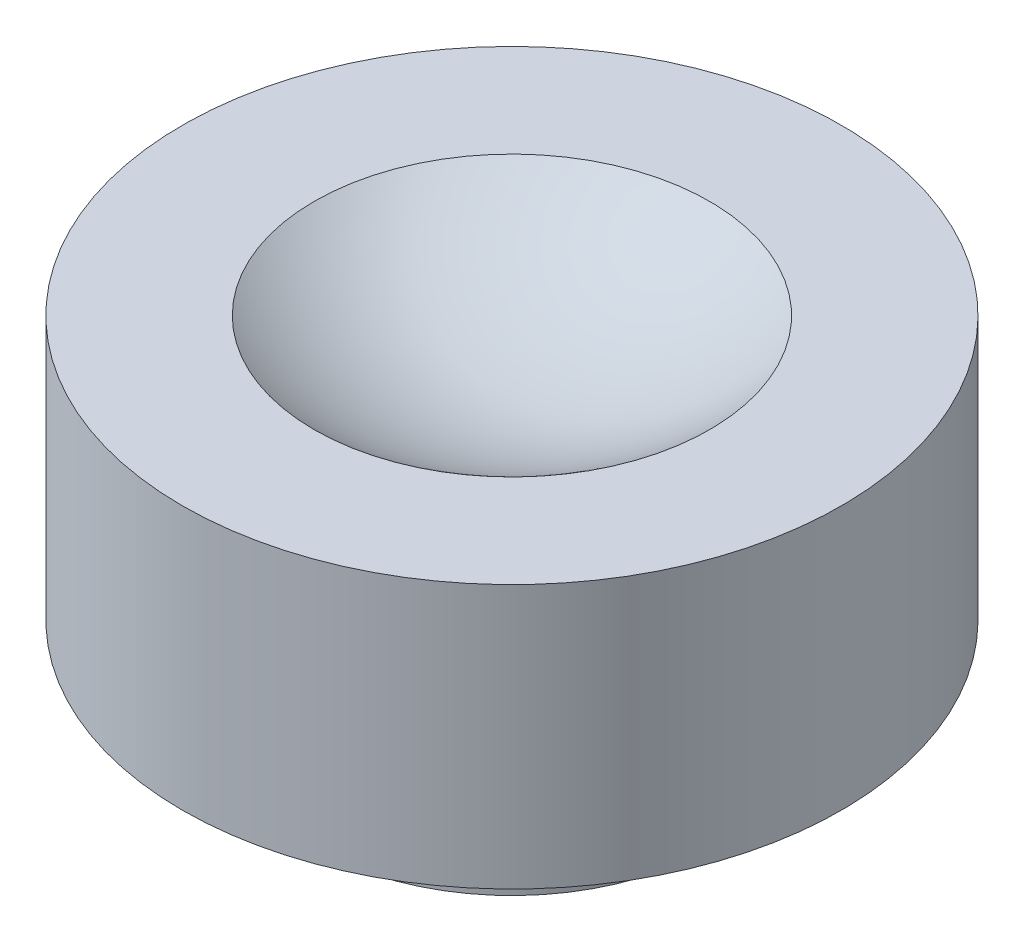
ISO-10303-21;
HEADER;
FILE_DESCRIPTION(('STEP AP214'),'2;1');
FILE_NAME('part.step','',(''),(''),'','','');
FILE_SCHEMA(('AUTOMOTIVE_DESIGN { 1 0 10303 214 1 1 1 1 }'));
ENDSEC;
DATA;
#1=APPLICATION_CONTEXT('core data for automotive mechanical design processes');
#2=APPLICATION_PROTOCOL_DEFINITION('international standard','automotive_design',2000,#1);
#3=PRODUCT_CONTEXT('',#1,'mechanical');
#4=PRODUCT('Part','Part','',(#3));
#5=PRODUCT_RELATED_PRODUCT_CATEGORY('part','',(#4));
#6=PRODUCT_DEFINITION_FORMATION('','',#4);
#7=PRODUCT_DEFINITION_CONTEXT('part definition',#1,'design');
#8=PRODUCT_DEFINITION('design','',#6,#7);
#9=PRODUCT_DEFINITION_SHAPE('','',#8);
#10=(LENGTH_UNIT() NAMED_UNIT(*) SI_UNIT(.MILLI.,.METRE.));
#11=(NAMED_UNIT(*) PLANE_ANGLE_UNIT() SI_UNIT($,.RADIAN.));
#12=(NAMED_UNIT(*) SI_UNIT($,.STERADIAN.) SOLID_ANGLE_UNIT());
#13=UNCERTAINTY_MEASURE_WITH_UNIT(LENGTH_MEASURE(1.E-05),#10,'distance_accuracy_value','');
#14=(GEOMETRIC_REPRESENTATION_CONTEXT(3) GLOBAL_UNCERTAINTY_ASSIGNED_CONTEXT((#13)) GLOBAL_UNIT_ASSIGNED_CONTEXT((#10,
#11,#12)) REPRESENTATION_CONTEXT('',''));
#15=CARTESIAN_POINT('',(0.,0.,0.));
#16=DIRECTION('',(0.,0.,1.));
#17=DIRECTION('',(1.,0.,0.));
#18=AXIS2_PLACEMENT_3D('',#15,#16,#17);
#19=CARTESIAN_POINT('',(-3.,34.5,0.));
#20=DIRECTION('',(0.,-1.,0.));
#21=DIRECTION('',(0.,0.,-1.));
#22=AXIS2_PLACEMENT_3D('',#19,#20,#21);
#23=PLANE('',#22);
#24=CARTESIAN_POINT('',(0.,34.5,0.));
#25=DIRECTION('',(0.,1.,0.));
#26=DIRECTION('',(0.,0.,1.));
#27=AXIS2_PLACEMENT_3D('',#24,#25,#26);
#28=CIRCLE('',#27,3.);
#29=CARTESIAN_POINT('',(0.,34.5,3.));
#30=VERTEX_POINT('',#29);
#31=EDGE_CURVE('E10',#30,#30,#28,.T.);
#32=ORIENTED_EDGE('',*,*,#31,.F.);
#33=EDGE_LOOP('',(#32));
#34=FACE_BOUND('',#33,.T.);
#35=ADVANCED_FACE('F30',(#34),#23,.T.);
#36=CARTESIAN_POINT('',(0.,60.,0.));
#37=DIRECTION('',(0.,1.,0.));
#38=DIRECTION('',(0.,0.,1.));
#39=AXIS2_PLACEMENT_3D('',#36,#37,#38);
#40=CYLINDRICAL_SURFACE('',#39,3.);
#41=ORIENTED_EDGE('',*,*,#31,.T.);
#42=EDGE_LOOP('',(#41));
#43=FACE_BOUND('',#42,.T.);
#44=CARTESIAN_POINT('',(0.,36.,0.));
#45=DIRECTION('',(0.,1.,0.));
#46=DIRECTION('',(0.,0.,1.));
#47=AXIS2_PLACEMENT_3D('',#44,#45,#46);
#48=CIRCLE('',#47,3.);
#49=CARTESIAN_POINT('',(0.,36.,3.));
#50=VERTEX_POINT('',#49);
#51=EDGE_CURVE('E36',#50,#50,#48,.T.);
#52=ORIENTED_EDGE('',*,*,#51,.F.);
#53=EDGE_LOOP('',(#52));
#54=FACE_BOUND('',#53,.T.);
#55=ADVANCED_FACE('F69',(#43,#54),#40,.T.);
#56=CARTESIAN_POINT('',(-5.,36.,0.));
#57=DIRECTION('',(0.,-1.,0.));
#58=DIRECTION('',(0.,0.,-1.));
#59=AXIS2_PLACEMENT_3D('',#56,#57,#58);
#60=PLANE('',#59);
#61=ORIENTED_EDGE('',*,*,#51,.T.);
#62=EDGE_LOOP('',(#61));
#63=FACE_BOUND('',#62,.T.);
#64=CARTESIAN_POINT('',(0.,36.,0.));
#65=DIRECTION('',(0.,1.,0.));
#66=DIRECTION('',(0.,0.,1.));
#67=AXIS2_PLACEMENT_3D('',#64,#65,#66);
#68=CIRCLE('',#67,5.);
#69=CARTESIAN_POINT('',(0.,36.,5.));
#70=VERTEX_POINT('',#69);
#71=EDGE_CURVE('E40',#70,#70,#68,.T.);
#72=ORIENTED_EDGE('',*,*,#71,.F.);
#73=EDGE_LOOP('',(#72));
#74=FACE_BOUND('',#73,.T.);
#75=ADVANCED_FACE('F65',(#63,#74),#60,.T.);
#76=CARTESIAN_POINT('',(0.,60.,0.));
#77=DIRECTION('',(0.,1.,0.));
#78=DIRECTION('',(0.,0.,1.));
#79=AXIS2_PLACEMENT_3D('',#76,#77,#78);
#80=CYLINDRICAL_SURFACE('',#79,5.);
#81=ORIENTED_EDGE('',*,*,#71,.T.);
#82=EDGE_LOOP('',(#81));
#83=FACE_BOUND('',#82,.T.);
#84=CARTESIAN_POINT('',(0.,40.,0.));
#85=DIRECTION('',(0.,1.,0.));
#86=DIRECTION('',(0.,0.,1.));
#87=AXIS2_PLACEMENT_3D('',#84,#85,#86);
#88=CIRCLE('',#87,5.);
#89=CARTESIAN_POINT('',(0.,40.,5.));
#90=VERTEX_POINT('',#89);
#91=EDGE_CURVE('E44',#90,#90,#88,.T.);
#92=ORIENTED_EDGE('',*,*,#91,.F.);
#93=EDGE_LOOP('',(#92));
#94=FACE_BOUND('',#93,.T.);
#95=ADVANCED_FACE('F57',(#83,#94),#80,.T.);
#96=CARTESIAN_POINT('',(-3.,40.,0.));
#97=DIRECTION('',(0.,1.,0.));
#98=DIRECTION('',(0.,0.,1.));
#99=AXIS2_PLACEMENT_3D('',#96,#97,#98);
#100=PLANE('',#99);
#101=ORIENTED_EDGE('',*,*,#91,.T.);
#102=EDGE_LOOP('',(#101));
#103=FACE_BOUND('',#102,.T.);
#104=CARTESIAN_POINT('',(0.,40.,0.));
#105=DIRECTION('',(0.,1.,0.));
#106=DIRECTION('',(0.,0.,1.));
#107=AXIS2_PLACEMENT_3D('',#104,#105,#106);
#108=CIRCLE('',#107,3.);
#109=CARTESIAN_POINT('',(0.,40.,3.));
#110=VERTEX_POINT('',#109);
#111=EDGE_CURVE('E49',#110,#110,#108,.T.);
#112=ORIENTED_EDGE('',*,*,#111,.F.);
#113=EDGE_LOOP('',(#112));
#114=FACE_BOUND('',#113,.T.);
#115=ADVANCED_FACE('F55',(#103,#114),#100,.T.);
#116=CARTESIAN_POINT('',(0.,44.,0.));
#117=DIRECTION('',(0.,1.,0.));
#118=DIRECTION('',(-1.,0.,0.));
#119=AXIS2_PLACEMENT_3D('',#116,#117,#118);
#120=SPHERICAL_SURFACE('',#119,5.);
#121=ORIENTED_EDGE('',*,*,#111,.T.);
#122=EDGE_LOOP('',(#121));
#123=FACE_BOUND('',#122,.T.);
#124=ADVANCED_FACE('F53',(#123),#120,.F.);
#125=CLOSED_SHELL('',(#35,#55,#75,#95,#115,#124));
#126=MANIFOLD_SOLID_BREP('B2',#125);
#127=ADVANCED_BREP_SHAPE_REPRESENTATION('',(#18,#126),#14);
#128=SHAPE_DEFINITION_REPRESENTATION(#9,#127);
ENDSEC;
END-ISO-10303-21;
